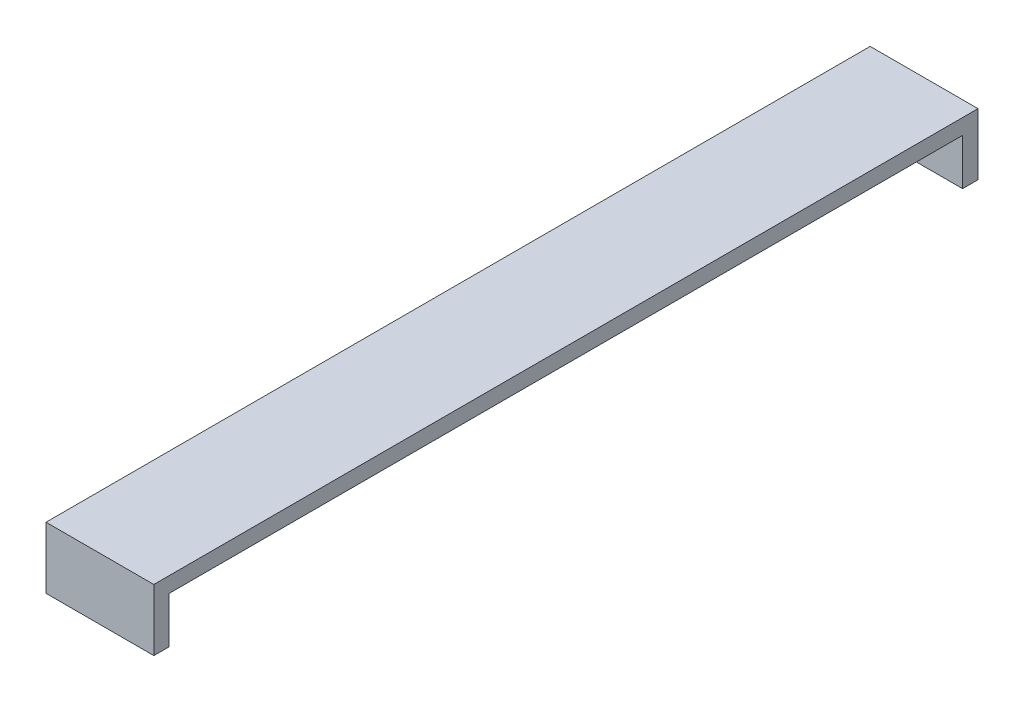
ISO-10303-21;
HEADER;
FILE_DESCRIPTION(('STEP AP214'),'2;1');
FILE_NAME('part.step','',(''),(''),'','','');
FILE_SCHEMA(('AUTOMOTIVE_DESIGN { 1 0 10303 214 1 1 1 1 }'));
ENDSEC;
DATA;
#1=APPLICATION_CONTEXT('core data for automotive mechanical design processes');
#2=APPLICATION_PROTOCOL_DEFINITION('international standard','automotive_design',2000,#1);
#3=PRODUCT_CONTEXT('',#1,'mechanical');
#4=PRODUCT('Part','Part','',(#3));
#5=PRODUCT_RELATED_PRODUCT_CATEGORY('part','',(#4));
#6=PRODUCT_DEFINITION_FORMATION('','',#4);
#7=PRODUCT_DEFINITION_CONTEXT('part definition',#1,'design');
#8=PRODUCT_DEFINITION('design','',#6,#7);
#9=PRODUCT_DEFINITION_SHAPE('','',#8);
#10=(LENGTH_UNIT() NAMED_UNIT(*) SI_UNIT(.MILLI.,.METRE.));
#11=(NAMED_UNIT(*) PLANE_ANGLE_UNIT() SI_UNIT($,.RADIAN.));
#12=(NAMED_UNIT(*) SI_UNIT($,.STERADIAN.) SOLID_ANGLE_UNIT());
#13=UNCERTAINTY_MEASURE_WITH_UNIT(LENGTH_MEASURE(1.E-05),#10,'distance_accuracy_value','');
#14=(GEOMETRIC_REPRESENTATION_CONTEXT(3) GLOBAL_UNCERTAINTY_ASSIGNED_CONTEXT((#13)) GLOBAL_UNIT_ASSIGNED_CONTEXT((#10,
#11,#12)) REPRESENTATION_CONTEXT('',''));
#15=CARTESIAN_POINT('',(0.,0.,0.));
#16=DIRECTION('',(0.,0.,1.));
#17=DIRECTION('',(1.,0.,0.));
#18=AXIS2_PLACEMENT_3D('',#15,#16,#17);
#19=CARTESIAN_POINT('',(-3.5,0.,53.5));
#20=DIRECTION('',(0.,1.,0.));
#21=DIRECTION('',(0.,0.,1.));
#22=AXIS2_PLACEMENT_3D('',#19,#20,#21);
#23=PLANE('',#22);
#24=DIRECTION('',(-1.,0.,0.));
#25=VECTOR('',#24,1.);
#26=CARTESIAN_POINT('',(3.5,0.,1.));
#27=LINE('',#26,#25);
#28=CARTESIAN_POINT('',(3.5,0.,1.));
#29=VERTEX_POINT('',#28);
#30=CARTESIAN_POINT('',(-3.5,0.,1.));
#31=VERTEX_POINT('',#30);
#32=EDGE_CURVE('E58',#29,#31,#27,.T.);
#33=ORIENTED_EDGE('',*,*,#32,.F.);
#34=DIRECTION('',(0.,0.,-1.));
#35=VECTOR('',#34,1.);
#36=CARTESIAN_POINT('',(3.5,0.,53.5));
#37=LINE('',#36,#35);
#38=CARTESIAN_POINT('',(3.5,0.,52.5));
#39=VERTEX_POINT('',#38);
#40=EDGE_CURVE('E48',#39,#29,#37,.T.);
#41=ORIENTED_EDGE('',*,*,#40,.F.);
#42=DIRECTION('',(1.,0.,0.));
#43=VECTOR('',#42,1.);
#44=CARTESIAN_POINT('',(3.5,0.,52.5));
#45=LINE('',#44,#43);
#46=CARTESIAN_POINT('',(-3.5,0.,52.5));
#47=VERTEX_POINT('',#46);
#48=EDGE_CURVE('E126',#47,#39,#45,.T.);
#49=ORIENTED_EDGE('',*,*,#48,.F.);
#50=DIRECTION('',(0.,0.,-1.));
#51=VECTOR('',#50,1.);
#52=CARTESIAN_POINT('',(-3.5,0.,53.5));
#53=LINE('',#52,#51);
#54=EDGE_CURVE('E11',#47,#31,#53,.T.);
#55=ORIENTED_EDGE('',*,*,#54,.T.);
#56=EDGE_LOOP('',(#33,#41,#49,#55));
#57=FACE_BOUND('',#56,.T.);
#58=ADVANCED_FACE('F39',(#57),#23,.F.);
#59=CARTESIAN_POINT('',(-3.5,0.,53.5));
#60=DIRECTION('',(1.,0.,0.));
#61=DIRECTION('',(0.,0.,-1.));
#62=AXIS2_PLACEMENT_3D('',#59,#60,#61);
#63=PLANE('',#62);
#64=DIRECTION('',(0.,-1.,0.));
#65=VECTOR('',#64,1.);
#66=CARTESIAN_POINT('',(-3.5,0.,0.));
#67=LINE('',#66,#65);
#68=CARTESIAN_POINT('',(-3.5,1.,0.));
#69=VERTEX_POINT('',#68);
#70=CARTESIAN_POINT('',(-3.5,-3.,0.));
#71=VERTEX_POINT('',#70);
#72=EDGE_CURVE('E107',#69,#71,#67,.T.);
#73=ORIENTED_EDGE('',*,*,#72,.T.);
#74=DIRECTION('',(0.,0.,-1.));
#75=VECTOR('',#74,1.);
#76=CARTESIAN_POINT('',(-3.50000000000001,-3.,1.));
#77=LINE('',#76,#75);
#78=CARTESIAN_POINT('',(-3.50000000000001,-3.,1.));
#79=VERTEX_POINT('',#78);
#80=EDGE_CURVE('E101',#79,#71,#77,.T.);
#81=ORIENTED_EDGE('',*,*,#80,.F.);
#82=DIRECTION('',(0.,1.,0.));
#83=VECTOR('',#82,1.);
#84=CARTESIAN_POINT('',(-3.50000000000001,-3.,1.));
#85=LINE('',#84,#83);
#86=EDGE_CURVE('E104',#79,#31,#85,.T.);
#87=ORIENTED_EDGE('',*,*,#86,.T.);
#88=ORIENTED_EDGE('',*,*,#54,.F.);
#89=DIRECTION('',(0.,1.,0.));
#90=VECTOR('',#89,1.);
#91=CARTESIAN_POINT('',(-3.50000000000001,-3.,52.5));
#92=LINE('',#91,#90);
#93=CARTESIAN_POINT('',(-3.50000000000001,-3.,52.5));
#94=VERTEX_POINT('',#93);
#95=EDGE_CURVE('E155',#94,#47,#92,.T.);
#96=ORIENTED_EDGE('',*,*,#95,.F.);
#97=DIRECTION('',(0.,0.,-1.));
#98=VECTOR('',#97,1.);
#99=CARTESIAN_POINT('',(-3.50000000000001,-3.,52.5));
#100=LINE('',#99,#98);
#101=CARTESIAN_POINT('',(-3.5,-3.,53.5));
#102=VERTEX_POINT('',#101);
#103=EDGE_CURVE('E132',#102,#94,#100,.T.);
#104=ORIENTED_EDGE('',*,*,#103,.F.);
#105=DIRECTION('',(0.,-1.,0.));
#106=VECTOR('',#105,1.);
#107=CARTESIAN_POINT('',(-3.5,0.,53.5));
#108=LINE('',#107,#106);
#109=CARTESIAN_POINT('',(-3.5,1.,53.5));
#110=VERTEX_POINT('',#109);
#111=EDGE_CURVE('E159',#110,#102,#108,.T.);
#112=ORIENTED_EDGE('',*,*,#111,.F.);
#113=DIRECTION('',(0.,0.,-1.));
#114=VECTOR('',#113,1.);
#115=CARTESIAN_POINT('',(-3.5,1.,53.5));
#116=LINE('',#115,#114);
#117=EDGE_CURVE('E169',#110,#69,#116,.T.);
#118=ORIENTED_EDGE('',*,*,#117,.T.);
#119=EDGE_LOOP('',(#73,#81,#87,#88,#96,#104,#112,#118));
#120=FACE_BOUND('',#119,.T.);
#121=ADVANCED_FACE('F41',(#120),#63,.F.);
#122=CARTESIAN_POINT('',(3.5,0.,53.5));
#123=DIRECTION('',(-1.,0.,0.));
#124=DIRECTION('',(0.,-1.,0.));
#125=AXIS2_PLACEMENT_3D('',#122,#123,#124);
#126=PLANE('',#125);
#127=DIRECTION('',(0.,1.,0.));
#128=VECTOR('',#127,1.);
#129=CARTESIAN_POINT('',(3.5,0.,0.));
#130=LINE('',#129,#128);
#131=CARTESIAN_POINT('',(3.5,-3.,0.));
#132=VERTEX_POINT('',#131);
#133=CARTESIAN_POINT('',(3.5,1.,0.));
#134=VERTEX_POINT('',#133);
#135=EDGE_CURVE('E172',#132,#134,#130,.T.);
#136=ORIENTED_EDGE('',*,*,#135,.T.);
#137=DIRECTION('',(0.,0.,-1.));
#138=VECTOR('',#137,1.);
#139=CARTESIAN_POINT('',(3.5,1.,53.5));
#140=LINE('',#139,#138);
#141=CARTESIAN_POINT('',(3.5,1.,53.5));
#142=VERTEX_POINT('',#141);
#143=EDGE_CURVE('E179',#142,#134,#140,.T.);
#144=ORIENTED_EDGE('',*,*,#143,.F.);
#145=DIRECTION('',(0.,1.,0.));
#146=VECTOR('',#145,1.);
#147=CARTESIAN_POINT('',(3.5,0.,53.5));
#148=LINE('',#147,#146);
#149=CARTESIAN_POINT('',(3.5,-3.,53.5));
#150=VERTEX_POINT('',#149);
#151=EDGE_CURVE('E162',#150,#142,#148,.T.);
#152=ORIENTED_EDGE('',*,*,#151,.F.);
#153=DIRECTION('',(0.,0.,1.));
#154=VECTOR('',#153,1.);
#155=CARTESIAN_POINT('',(3.5,-3.,53.5));
#156=LINE('',#155,#154);
#157=CARTESIAN_POINT('',(3.5,-3.,52.5));
#158=VERTEX_POINT('',#157);
#159=EDGE_CURVE('E143',#158,#150,#156,.T.);
#160=ORIENTED_EDGE('',*,*,#159,.F.);
#161=DIRECTION('',(0.,1.,0.));
#162=VECTOR('',#161,1.);
#163=CARTESIAN_POINT('',(3.5,-3.,52.5));
#164=LINE('',#163,#162);
#165=EDGE_CURVE('E150',#158,#39,#164,.T.);
#166=ORIENTED_EDGE('',*,*,#165,.T.);
#167=ORIENTED_EDGE('',*,*,#40,.T.);
#168=DIRECTION('',(0.,1.,0.));
#169=VECTOR('',#168,1.);
#170=CARTESIAN_POINT('',(3.5,-3.,1.));
#171=LINE('',#170,#169);
#172=CARTESIAN_POINT('',(3.5,-3.,1.));
#173=VERTEX_POINT('',#172);
#174=EDGE_CURVE('E127',#173,#29,#171,.T.);
#175=ORIENTED_EDGE('',*,*,#174,.F.);
#176=DIRECTION('',(0.,0.,1.));
#177=VECTOR('',#176,1.);
#178=CARTESIAN_POINT('',(3.5,-3.,0.));
#179=LINE('',#178,#177);
#180=EDGE_CURVE('E118',#132,#173,#179,.T.);
#181=ORIENTED_EDGE('',*,*,#180,.F.);
#182=EDGE_LOOP('',(#136,#144,#152,#160,#166,#167,#175,#181));
#183=FACE_BOUND('',#182,.T.);
#184=ADVANCED_FACE('F184',(#183),#126,.F.);
#185=CARTESIAN_POINT('',(3.5,1.,53.5));
#186=DIRECTION('',(0.,-1.,0.));
#187=DIRECTION('',(0.,0.,-1.));
#188=AXIS2_PLACEMENT_3D('',#185,#186,#187);
#189=PLANE('',#188);
#190=DIRECTION('',(-1.,0.,0.));
#191=VECTOR('',#190,1.);
#192=CARTESIAN_POINT('',(3.5,1.,0.));
#193=LINE('',#192,#191);
#194=EDGE_CURVE('E163',#134,#69,#193,.T.);
#195=ORIENTED_EDGE('',*,*,#194,.T.);
#196=ORIENTED_EDGE('',*,*,#117,.F.);
#197=DIRECTION('',(-1.,0.,0.));
#198=VECTOR('',#197,1.);
#199=CARTESIAN_POINT('',(3.5,1.,53.5));
#200=LINE('',#199,#198);
#201=EDGE_CURVE('E166',#142,#110,#200,.T.);
#202=ORIENTED_EDGE('',*,*,#201,.F.);
#203=ORIENTED_EDGE('',*,*,#143,.T.);
#204=EDGE_LOOP('',(#195,#196,#202,#203));
#205=FACE_BOUND('',#204,.T.);
#206=ADVANCED_FACE('F201',(#205),#189,.F.);
#207=CARTESIAN_POINT('',(0.,0.,53.5));
#208=DIRECTION('',(0.,0.,1.));
#209=DIRECTION('',(1.,0.,0.));
#210=AXIS2_PLACEMENT_3D('',#207,#208,#209);
#211=PLANE('',#210);
#212=ORIENTED_EDGE('',*,*,#111,.T.);
#213=DIRECTION('',(-1.,0.,0.));
#214=VECTOR('',#213,1.);
#215=CARTESIAN_POINT('',(-3.5,-3.,53.5));
#216=LINE('',#215,#214);
#217=EDGE_CURVE('E147',#150,#102,#216,.T.);
#218=ORIENTED_EDGE('',*,*,#217,.F.);
#219=ORIENTED_EDGE('',*,*,#151,.T.);
#220=ORIENTED_EDGE('',*,*,#201,.T.);
#221=EDGE_LOOP('',(#212,#218,#219,#220));
#222=FACE_BOUND('',#221,.T.);
#223=ADVANCED_FACE('F196',(#222),#211,.T.);
#224=CARTESIAN_POINT('',(0.,0.,0.));
#225=DIRECTION('',(0.,0.,1.));
#226=DIRECTION('',(1.,0.,0.));
#227=AXIS2_PLACEMENT_3D('',#224,#225,#226);
#228=PLANE('',#227);
#229=ORIENTED_EDGE('',*,*,#72,.F.);
#230=ORIENTED_EDGE('',*,*,#194,.F.);
#231=ORIENTED_EDGE('',*,*,#135,.F.);
#232=DIRECTION('',(1.,0.,0.));
#233=VECTOR('',#232,1.);
#234=CARTESIAN_POINT('',(-3.5,-3.,0.));
#235=LINE('',#234,#233);
#236=EDGE_CURVE('E112',#71,#132,#235,.T.);
#237=ORIENTED_EDGE('',*,*,#236,.F.);
#238=EDGE_LOOP('',(#229,#230,#231,#237));
#239=FACE_BOUND('',#238,.T.);
#240=ADVANCED_FACE('F204',(#239),#228,.F.);
#241=CARTESIAN_POINT('',(3.5,-3.,52.5));
#242=DIRECTION('',(0.,0.,1.));
#243=DIRECTION('',(1.,0.,0.));
#244=AXIS2_PLACEMENT_3D('',#241,#242,#243);
#245=PLANE('',#244);
#246=ORIENTED_EDGE('',*,*,#48,.T.);
#247=ORIENTED_EDGE('',*,*,#165,.F.);
#248=DIRECTION('',(1.,0.,0.));
#249=VECTOR('',#248,1.);
#250=CARTESIAN_POINT('',(3.5,-3.,52.5));
#251=LINE('',#250,#249);
#252=EDGE_CURVE('E140',#94,#158,#251,.T.);
#253=ORIENTED_EDGE('',*,*,#252,.F.);
#254=ORIENTED_EDGE('',*,*,#95,.T.);
#255=EDGE_LOOP('',(#246,#247,#253,#254));
#256=FACE_BOUND('',#255,.T.);
#257=ADVANCED_FACE('F188',(#256),#245,.F.);
#258=CARTESIAN_POINT('',(0.,-3.,0.));
#259=DIRECTION('',(0.,1.,0.));
#260=DIRECTION('',(0.,0.,1.));
#261=AXIS2_PLACEMENT_3D('',#258,#259,#260);
#262=PLANE('',#261);
#263=ORIENTED_EDGE('',*,*,#103,.T.);
#264=ORIENTED_EDGE('',*,*,#252,.T.);
#265=ORIENTED_EDGE('',*,*,#159,.T.);
#266=ORIENTED_EDGE('',*,*,#217,.T.);
#267=EDGE_LOOP('',(#263,#264,#265,#266));
#268=FACE_BOUND('',#267,.T.);
#269=ADVANCED_FACE('F193',(#268),#262,.F.);
#270=CARTESIAN_POINT('',(3.5,-3.,1.));
#271=DIRECTION('',(0.,0.,-1.));
#272=DIRECTION('',(-1.,0.,0.));
#273=AXIS2_PLACEMENT_3D('',#270,#271,#272);
#274=PLANE('',#273);
#275=ORIENTED_EDGE('',*,*,#32,.T.);
#276=ORIENTED_EDGE('',*,*,#86,.F.);
#277=DIRECTION('',(-1.,0.,0.));
#278=VECTOR('',#277,1.);
#279=CARTESIAN_POINT('',(3.5,-3.,1.));
#280=LINE('',#279,#278);
#281=EDGE_CURVE('E113',#173,#79,#280,.T.);
#282=ORIENTED_EDGE('',*,*,#281,.F.);
#283=ORIENTED_EDGE('',*,*,#174,.T.);
#284=EDGE_LOOP('',(#275,#276,#282,#283));
#285=FACE_BOUND('',#284,.T.);
#286=ADVANCED_FACE('F124',(#285),#274,.F.);
#287=CARTESIAN_POINT('',(0.,-3.,0.));
#288=DIRECTION('',(0.,-1.,0.));
#289=DIRECTION('',(0.,0.,-1.));
#290=AXIS2_PLACEMENT_3D('',#287,#288,#289);
#291=PLANE('',#290);
#292=ORIENTED_EDGE('',*,*,#281,.T.);
#293=ORIENTED_EDGE('',*,*,#80,.T.);
#294=ORIENTED_EDGE('',*,*,#236,.T.);
#295=ORIENTED_EDGE('',*,*,#180,.T.);
#296=EDGE_LOOP('',(#292,#293,#294,#295));
#297=FACE_BOUND('',#296,.T.);
#298=ADVANCED_FACE('F116',(#297),#291,.T.);
#299=CLOSED_SHELL('',(#58,#121,#184,#206,#223,#240,#257,#269,#286,#298));
#300=MANIFOLD_SOLID_BREP('B2',#299);
#301=ADVANCED_BREP_SHAPE_REPRESENTATION('',(#18,#300),#14);
#302=SHAPE_DEFINITION_REPRESENTATION(#9,#301);
ENDSEC;
END-ISO-10303-21;
